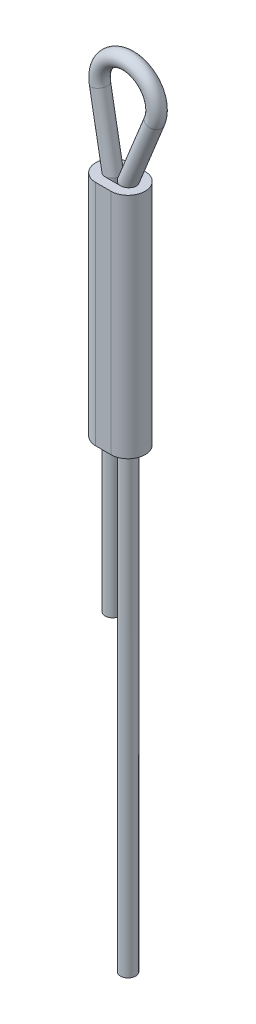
from build123d import *

# Parameters (mm, degrees)
ESQUISSE11_R       = 0.2
BOSS_EXTRU_2_DEPTH = 6


with BuildPart() as part:
    # Balayage1: sweep along a path in Esquisse10
    with BuildLine(Plane.XY) as balayage1_path:
        Line((0, -20), (0, -2))
        Line((0, -2), (0.695268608, -0.28125))
        ThreePointArc((0.695268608, -0.28125), (0.076829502, 0.74605444), (-0.737995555, -0.133650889))
        Line((-0.737995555, -0.133650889), (-0.4, -2))
        Line((-0.4, -2), (-0.4, -12))
    # Esquisse11 → Balayage1 (sweep)
    with BuildSketch(Plane(origin=(-0.4, -12, 0), x_dir=(1, 0, 0), z_dir=(0, -1, 0))):
        Circle(ESQUISSE11_R)
    sweep(path=balayage1_path.line, transition=Transition.RIGHT)


with BuildPart() as body_2:
    # Esquisse12 → Boss.-Extru.2 (new body)
    with BuildSketch(Plane.XZ.offset(2)):
        with BuildLine():
            Line((-0.4, 0.45), (0, 0.45))
            ThreePointArc((0, 0.45), (0.45, 0), (0, -0.45))
            Line((0, -0.45), (-0.4, -0.45))
            ThreePointArc((-0.4, -0.45), (-0.85, 0), (-0.4, 0.45))
        make_face()
        with BuildLine():
            Line((-0.4, 0.2), (0, 0.2))
            ThreePointArc((0, 0.2), (0.2, 0), (0, -0.2))
            Line((0, -0.2), (-0.4, -0.2))
            ThreePointArc((-0.4, -0.2), (-0.6, 0), (-0.4, 0.2))
        make_face(mode=Mode.SUBTRACT)
    extrude(amount=BOSS_EXTRU_2_DEPTH)


solid = Compound([part.part, body_2.part])
